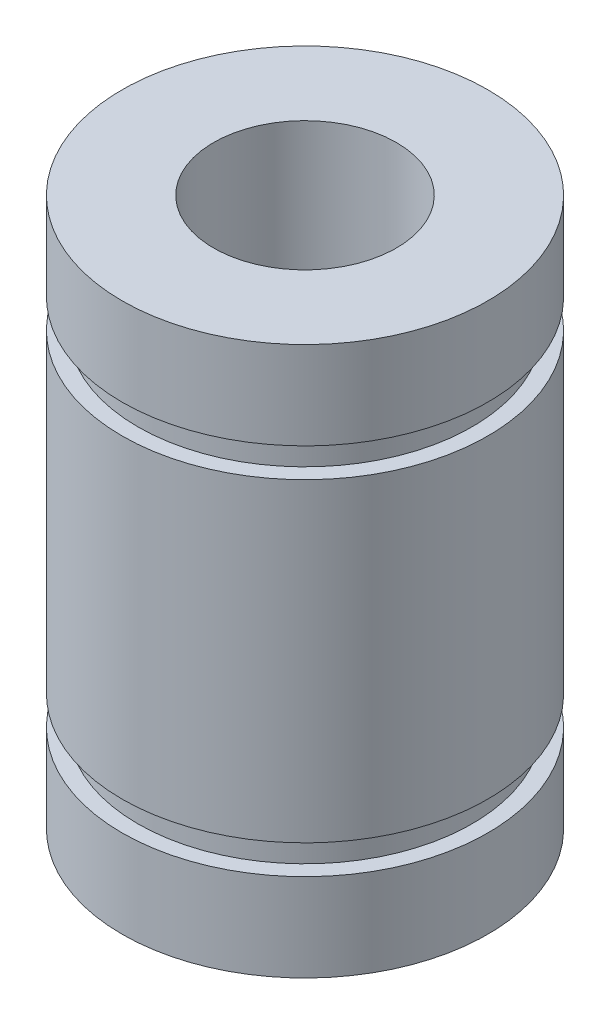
ISO-10303-21;
HEADER;
FILE_DESCRIPTION(('STEP AP214'),'2;1');
FILE_NAME('part.step','',(''),(''),'','','');
FILE_SCHEMA(('AUTOMOTIVE_DESIGN { 1 0 10303 214 1 1 1 1 }'));
ENDSEC;
DATA;
#1=APPLICATION_CONTEXT('core data for automotive mechanical design processes');
#2=APPLICATION_PROTOCOL_DEFINITION('international standard','automotive_design',2000,#1);
#3=PRODUCT_CONTEXT('',#1,'mechanical');
#4=PRODUCT('Part','Part','',(#3));
#5=PRODUCT_RELATED_PRODUCT_CATEGORY('part','',(#4));
#6=PRODUCT_DEFINITION_FORMATION('','',#4);
#7=PRODUCT_DEFINITION_CONTEXT('part definition',#1,'design');
#8=PRODUCT_DEFINITION('design','',#6,#7);
#9=PRODUCT_DEFINITION_SHAPE('','',#8);
#10=(LENGTH_UNIT() NAMED_UNIT(*) SI_UNIT(.MILLI.,.METRE.));
#11=(NAMED_UNIT(*) PLANE_ANGLE_UNIT() SI_UNIT($,.RADIAN.));
#12=(NAMED_UNIT(*) SI_UNIT($,.STERADIAN.) SOLID_ANGLE_UNIT());
#13=UNCERTAINTY_MEASURE_WITH_UNIT(LENGTH_MEASURE(1.E-05),#10,'distance_accuracy_value','');
#14=(GEOMETRIC_REPRESENTATION_CONTEXT(3) GLOBAL_UNCERTAINTY_ASSIGNED_CONTEXT((#13)) GLOBAL_UNIT_ASSIGNED_CONTEXT((#10,
#11,#12)) REPRESENTATION_CONTEXT('',''));
#15=CARTESIAN_POINT('',(0.,0.,0.));
#16=DIRECTION('',(0.,0.,1.));
#17=DIRECTION('',(1.,0.,0.));
#18=AXIS2_PLACEMENT_3D('',#15,#16,#17);
#19=CARTESIAN_POINT('',(0.,19.05,0.));
#20=DIRECTION('',(0.,-1.,0.));
#21=DIRECTION('',(0.,0.,-1.));
#22=AXIS2_PLACEMENT_3D('',#19,#20,#21);
#23=CYLINDRICAL_SURFACE('',#22,6.35);
#24=CARTESIAN_POINT('',(0.,19.05,0.));
#25=DIRECTION('',(0.,1.,0.));
#26=DIRECTION('',(0.,0.,1.));
#27=AXIS2_PLACEMENT_3D('',#24,#25,#26);
#28=CIRCLE('',#27,6.35);
#29=CARTESIAN_POINT('',(0.,19.05,-6.35));
#30=VERTEX_POINT('',#29);
#31=EDGE_CURVE('E10',#30,#30,#28,.T.);
#32=CARTESIAN_POINT('',(0.,16.002,0.));
#33=DIRECTION('',(0.,-1.,0.));
#34=DIRECTION('',(0.,0.,-1.));
#35=AXIS2_PLACEMENT_3D('',#32,#33,#34);
#36=CIRCLE('',#35,6.35);
#37=CARTESIAN_POINT('',(0.,16.002,-6.35));
#38=VERTEX_POINT('',#37);
#39=EDGE_CURVE('E71',#38,#38,#36,.T.);
#40=CARTESIAN_POINT('',(0.,19.05,-6.35));
#41=CARTESIAN_POINT('',(0.,19.01825,-6.35));
#42=CARTESIAN_POINT('',(0.,18.9865,-6.35));
#43=CARTESIAN_POINT('',(0.,18.923,-6.35));
#44=CARTESIAN_POINT('',(0.,18.89125,-6.35));
#45=CARTESIAN_POINT('',(0.,18.82775,-6.35));
#46=CARTESIAN_POINT('',(0.,18.796,-6.35));
#47=CARTESIAN_POINT('',(0.,18.7325,-6.35));
#48=CARTESIAN_POINT('',(0.,18.70075,-6.35));
#49=CARTESIAN_POINT('',(0.,18.63725,-6.35));
#50=CARTESIAN_POINT('',(0.,18.6055,-6.35));
#51=CARTESIAN_POINT('',(0.,18.542,-6.35));
#52=CARTESIAN_POINT('',(0.,18.51025,-6.35));
#53=CARTESIAN_POINT('',(0.,18.44675,-6.35));
#54=CARTESIAN_POINT('',(0.,18.415,-6.35));
#55=CARTESIAN_POINT('',(0.,18.3515,-6.35));
#56=CARTESIAN_POINT('',(0.,18.31975,-6.35));
#57=CARTESIAN_POINT('',(0.,18.25625,-6.35));
#58=CARTESIAN_POINT('',(0.,18.2245,-6.35));
#59=CARTESIAN_POINT('',(0.,18.161,-6.35));
#60=CARTESIAN_POINT('',(0.,18.12925,-6.35));
#61=CARTESIAN_POINT('',(0.,18.06575,-6.35));
#62=CARTESIAN_POINT('',(0.,18.034,-6.35));
#63=CARTESIAN_POINT('',(0.,17.9705,-6.35));
#64=CARTESIAN_POINT('',(0.,17.93875,-6.35));
#65=CARTESIAN_POINT('',(0.,17.87525,-6.35));
#66=CARTESIAN_POINT('',(0.,17.8435,-6.35));
#67=CARTESIAN_POINT('',(0.,17.78,-6.35));
#68=CARTESIAN_POINT('',(0.,17.74825,-6.35));
#69=CARTESIAN_POINT('',(0.,17.68475,-6.35));
#70=CARTESIAN_POINT('',(0.,17.653,-6.35));
#71=CARTESIAN_POINT('',(0.,17.5895,-6.35));
#72=CARTESIAN_POINT('',(0.,17.55775,-6.35));
#73=CARTESIAN_POINT('',(0.,17.49425,-6.35));
#74=CARTESIAN_POINT('',(0.,17.4625,-6.35));
#75=CARTESIAN_POINT('',(0.,17.399,-6.35));
#76=CARTESIAN_POINT('',(0.,17.36725,-6.35));
#77=CARTESIAN_POINT('',(0.,17.30375,-6.35));
#78=CARTESIAN_POINT('',(0.,17.272,-6.35));
#79=CARTESIAN_POINT('',(0.,17.2085,-6.35));
#80=CARTESIAN_POINT('',(0.,17.17675,-6.35));
#81=CARTESIAN_POINT('',(0.,17.11325,-6.35));
#82=CARTESIAN_POINT('',(0.,17.0815,-6.35));
#83=CARTESIAN_POINT('',(0.,17.018,-6.35));
#84=CARTESIAN_POINT('',(0.,16.98625,-6.35));
#85=CARTESIAN_POINT('',(0.,16.92275,-6.35));
#86=CARTESIAN_POINT('',(0.,16.891,-6.35));
#87=CARTESIAN_POINT('',(0.,16.8275,-6.35));
#88=CARTESIAN_POINT('',(0.,16.79575,-6.35));
#89=CARTESIAN_POINT('',(0.,16.73225,-6.35));
#90=CARTESIAN_POINT('',(0.,16.7005,-6.35));
#91=CARTESIAN_POINT('',(0.,16.637,-6.35));
#92=CARTESIAN_POINT('',(0.,16.60525,-6.35));
#93=CARTESIAN_POINT('',(0.,16.54175,-6.35));
#94=CARTESIAN_POINT('',(0.,16.51,-6.35));
#95=CARTESIAN_POINT('',(0.,16.4465,-6.35));
#96=CARTESIAN_POINT('',(0.,16.41475,-6.35));
#97=CARTESIAN_POINT('',(0.,16.35125,-6.35));
#98=CARTESIAN_POINT('',(0.,16.3195,-6.35));
#99=CARTESIAN_POINT('',(0.,16.256,-6.35));
#100=CARTESIAN_POINT('',(0.,16.22425,-6.35));
#101=CARTESIAN_POINT('',(0.,16.16075,-6.35));
#102=CARTESIAN_POINT('',(0.,16.129,-6.35));
#103=CARTESIAN_POINT('',(0.,16.0655,-6.35));
#104=CARTESIAN_POINT('',(0.,16.03375,-6.35));
#105=CARTESIAN_POINT('',(0.,16.002,-6.35));
#106=B_SPLINE_CURVE_WITH_KNOTS('',3,(#40,#41,#42,#43,#44,#45,#46,#47,#48,#49,#50,#51,#52,#53,
#54,#55,#56,#57,#58,#59,#60,#61,#62,#63,#64,#65,#66,#67,#68,#69,#70,#71,#72,#73,#74,#75,#76,#77,
#78,#79,#80,#81,#82,#83,#84,#85,#86,#87,#88,#89,#90,#91,#92,#93,#94,#95,#96,#97,#98,#99,#100,
#101,#102,#103,#104,#105),.UNSPECIFIED.,.F.,.F.,(4,2,2,2,2,2,2,2,2,2,2,2,2,2,2,2,2,2,2,2,2,2,2,
2,2,2,2,2,2,2,2,2,4),(0.,0.0952499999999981,0.190499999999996,0.285749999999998,
0.380999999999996,0.476249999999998,0.571499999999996,0.666749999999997,0.761999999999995,
0.857249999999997,0.952499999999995,1.04775,1.14299999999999,1.23825,1.33349999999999,1.42875,
1.52399999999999,1.61925,1.71449999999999,1.80975,1.90499999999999,2.00024999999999,
2.09549999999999,2.19074999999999,2.28599999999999,2.38124999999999,2.47649999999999,
2.57174999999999,2.66699999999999,2.76224999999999,2.85749999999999,2.95274999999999,
3.04799999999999),.UNSPECIFIED.);
#107=EDGE_CURVE('BSEAM38',#30,#38,#106,.T.);
#108=ORIENTED_EDGE('',*,*,#31,.F.);
#109=ORIENTED_EDGE('',*,*,#39,.F.);
#110=ORIENTED_EDGE('',*,*,#107,.T.);
#111=ORIENTED_EDGE('',*,*,#107,.F.);
#112=EDGE_LOOP('',(#108,#110,#109,#111));
#113=FACE_BOUND('',#112,.T.);
#114=ADVANCED_FACE('F38',(#113),#23,.T.);
#115=CARTESIAN_POINT('',(0.,0.,0.));
#116=DIRECTION('',(0.,1.,0.));
#117=DIRECTION('',(0.,0.,1.));
#118=AXIS2_PLACEMENT_3D('',#115,#116,#117);
#119=CIRCLE('',#118,6.35);
#120=CARTESIAN_POINT('',(0.,0.,-6.35));
#121=VERTEX_POINT('',#120);
#122=EDGE_CURVE('E41',#121,#121,#119,.T.);
#123=CARTESIAN_POINT('',(0.,3.048,0.));
#124=DIRECTION('',(0.,-1.,0.));
#125=DIRECTION('',(0.,0.,-1.));
#126=AXIS2_PLACEMENT_3D('',#123,#124,#125);
#127=CIRCLE('',#126,6.35);
#128=CARTESIAN_POINT('',(0.,3.048,-6.35));
#129=VERTEX_POINT('',#128);
#130=EDGE_CURVE('E66',#129,#129,#127,.T.);
#131=CARTESIAN_POINT('',(0.,0.,-6.35));
#132=CARTESIAN_POINT('',(0.,0.0317500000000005,-6.35));
#133=CARTESIAN_POINT('',(0.,0.0635000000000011,-6.35));
#134=CARTESIAN_POINT('',(0.,0.127000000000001,-6.35));
#135=CARTESIAN_POINT('',(0.,0.15875,-6.35));
#136=CARTESIAN_POINT('',(0.,0.22225,-6.35));
#137=CARTESIAN_POINT('',(0.,0.254000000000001,-6.35));
#138=CARTESIAN_POINT('',(0.,0.317500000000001,-6.35));
#139=CARTESIAN_POINT('',(0.,0.34925,-6.35));
#140=CARTESIAN_POINT('',(0.,0.41275,-6.35));
#141=CARTESIAN_POINT('',(0.,0.4445,-6.35));
#142=CARTESIAN_POINT('',(0.,0.508,-6.35));
#143=CARTESIAN_POINT('',(0.,0.53975,-6.35));
#144=CARTESIAN_POINT('',(0.,0.60325,-6.35));
#145=CARTESIAN_POINT('',(0.,0.635,-6.35));
#146=CARTESIAN_POINT('',(0.,0.6985,-6.35));
#147=CARTESIAN_POINT('',(0.,0.730249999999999,-6.35));
#148=CARTESIAN_POINT('',(0.,0.793749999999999,-6.35));
#149=CARTESIAN_POINT('',(0.,0.8255,-6.35));
#150=CARTESIAN_POINT('',(0.,0.889000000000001,-6.35));
#151=CARTESIAN_POINT('',(0.,0.920750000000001,-6.35));
#152=CARTESIAN_POINT('',(0.,0.984250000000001,-6.35));
#153=CARTESIAN_POINT('',(0.,1.016,-6.35));
#154=CARTESIAN_POINT('',(0.,1.0795,-6.35));
#155=CARTESIAN_POINT('',(0.,1.11125,-6.35));
#156=CARTESIAN_POINT('',(0.,1.17475,-6.35));
#157=CARTESIAN_POINT('',(0.,1.2065,-6.35));
#158=CARTESIAN_POINT('',(0.,1.27,-6.35));
#159=CARTESIAN_POINT('',(0.,1.30175,-6.35));
#160=CARTESIAN_POINT('',(0.,1.36525,-6.35));
#161=CARTESIAN_POINT('',(0.,1.397,-6.35));
#162=CARTESIAN_POINT('',(0.,1.4605,-6.35));
#163=CARTESIAN_POINT('',(0.,1.49225,-6.35));
#164=CARTESIAN_POINT('',(0.,1.55575,-6.35));
#165=CARTESIAN_POINT('',(0.,1.5875,-6.35));
#166=CARTESIAN_POINT('',(0.,1.651,-6.35));
#167=CARTESIAN_POINT('',(0.,1.68275,-6.35));
#168=CARTESIAN_POINT('',(0.,1.74625,-6.35));
#169=CARTESIAN_POINT('',(0.,1.778,-6.35));
#170=CARTESIAN_POINT('',(0.,1.8415,-6.35));
#171=CARTESIAN_POINT('',(0.,1.87325,-6.35));
#172=CARTESIAN_POINT('',(0.,1.93675,-6.35));
#173=CARTESIAN_POINT('',(0.,1.9685,-6.35));
#174=CARTESIAN_POINT('',(0.,2.032,-6.35));
#175=CARTESIAN_POINT('',(0.,2.06375,-6.35));
#176=CARTESIAN_POINT('',(0.,2.12725,-6.35));
#177=CARTESIAN_POINT('',(0.,2.159,-6.35));
#178=CARTESIAN_POINT('',(0.,2.2225,-6.35));
#179=CARTESIAN_POINT('',(0.,2.25425,-6.35));
#180=CARTESIAN_POINT('',(0.,2.31775,-6.35));
#181=CARTESIAN_POINT('',(0.,2.3495,-6.35));
#182=CARTESIAN_POINT('',(0.,2.413,-6.35));
#183=CARTESIAN_POINT('',(0.,2.44475,-6.35));
#184=CARTESIAN_POINT('',(0.,2.50825,-6.35));
#185=CARTESIAN_POINT('',(0.,2.54,-6.35));
#186=CARTESIAN_POINT('',(0.,2.6035,-6.35));
#187=CARTESIAN_POINT('',(0.,2.63525,-6.35));
#188=CARTESIAN_POINT('',(0.,2.69875,-6.35));
#189=CARTESIAN_POINT('',(0.,2.7305,-6.35));
#190=CARTESIAN_POINT('',(0.,2.794,-6.35));
#191=CARTESIAN_POINT('',(0.,2.82575,-6.35));
#192=CARTESIAN_POINT('',(0.,2.88925,-6.35));
#193=CARTESIAN_POINT('',(0.,2.921,-6.35));
#194=CARTESIAN_POINT('',(0.,2.9845,-6.35));
#195=CARTESIAN_POINT('',(0.,3.01625,-6.35));
#196=CARTESIAN_POINT('',(0.,3.048,-6.35));
#197=B_SPLINE_CURVE_WITH_KNOTS('',3,(#131,#132,#133,#134,#135,#136,#137,#138,#139,#140,#141,
#142,#143,#144,#145,#146,#147,#148,#149,#150,#151,#152,#153,#154,#155,#156,#157,#158,#159,#160,
#161,#162,#163,#164,#165,#166,#167,#168,#169,#170,#171,#172,#173,#174,#175,#176,#177,#178,#179,
#180,#181,#182,#183,#184,#185,#186,#187,#188,#189,#190,#191,#192,#193,#194,#195,#196),
.UNSPECIFIED.,.F.,.F.,(4,2,2,2,2,2,2,2,2,2,2,2,2,2,2,2,2,2,2,2,2,2,2,2,2,2,2,2,2,2,2,2,4),(0.,
0.0952500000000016,0.1905,0.285750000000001,0.380999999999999,0.476250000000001,
0.571499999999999,0.666750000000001,0.761999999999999,0.85725,0.952500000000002,1.04775,1.143,
1.23825,1.3335,1.42875,1.524,1.61925,1.7145,1.80975,1.905,2.00025,2.0955,2.19075,2.286,2.38125,
2.4765,2.57175,2.667,2.76225,2.8575,2.95275,3.048),.UNSPECIFIED.);
#198=EDGE_CURVE('BSEAM99',#121,#129,#197,.T.);
#199=ORIENTED_EDGE('',*,*,#122,.T.);
#200=ORIENTED_EDGE('',*,*,#130,.T.);
#201=ORIENTED_EDGE('',*,*,#198,.T.);
#202=ORIENTED_EDGE('',*,*,#198,.F.);
#203=EDGE_LOOP('',(#199,#201,#200,#202));
#204=FACE_BOUND('',#203,.T.);
#205=ADVANCED_FACE('F99',(#204),#23,.T.);
#206=CARTESIAN_POINT('',(0.,19.05,0.));
#207=DIRECTION('',(0.,1.,0.));
#208=DIRECTION('',(0.,0.,1.));
#209=AXIS2_PLACEMENT_3D('',#206,#207,#208);
#210=PLANE('',#209);
#211=ORIENTED_EDGE('',*,*,#31,.T.);
#212=EDGE_LOOP('',(#211));
#213=FACE_BOUND('',#212,.T.);
#214=CARTESIAN_POINT('',(0.,19.05,0.));
#215=DIRECTION('',(0.,1.,0.));
#216=DIRECTION('',(0.,0.,1.));
#217=AXIS2_PLACEMENT_3D('',#214,#215,#216);
#218=CIRCLE('',#217,3.175);
#219=CARTESIAN_POINT('',(0.,19.05,-3.175));
#220=VERTEX_POINT('',#219);
#221=EDGE_CURVE('E48',#220,#220,#218,.T.);
#222=ORIENTED_EDGE('',*,*,#221,.F.);
#223=EDGE_LOOP('',(#222));
#224=FACE_BOUND('',#223,.T.);
#225=ADVANCED_FACE('F105',(#213,#224),#210,.T.);
#226=CARTESIAN_POINT('',(0.,0.,0.));
#227=DIRECTION('',(0.,1.,0.));
#228=DIRECTION('',(0.,0.,1.));
#229=AXIS2_PLACEMENT_3D('',#226,#227,#228);
#230=PLANE('',#229);
#231=ORIENTED_EDGE('',*,*,#122,.F.);
#232=EDGE_LOOP('',(#231));
#233=FACE_BOUND('',#232,.T.);
#234=CARTESIAN_POINT('',(0.,0.,0.));
#235=DIRECTION('',(0.,1.,0.));
#236=DIRECTION('',(0.,0.,1.));
#237=AXIS2_PLACEMENT_3D('',#234,#235,#236);
#238=CIRCLE('',#237,3.175);
#239=CARTESIAN_POINT('',(0.,0.,-3.175));
#240=VERTEX_POINT('',#239);
#241=EDGE_CURVE('E50',#240,#240,#238,.T.);
#242=ORIENTED_EDGE('',*,*,#241,.T.);
#243=EDGE_LOOP('',(#242));
#244=FACE_BOUND('',#243,.T.);
#245=ADVANCED_FACE('F135',(#233,#244),#230,.F.);
#246=CARTESIAN_POINT('',(0.,19.05,0.));
#247=DIRECTION('',(0.,-1.,0.));
#248=DIRECTION('',(0.,0.,-1.));
#249=AXIS2_PLACEMENT_3D('',#246,#247,#248);
#250=CYLINDRICAL_SURFACE('',#249,3.175);
#251=CARTESIAN_POINT('',(0.,19.05,-3.175));
#252=CARTESIAN_POINT('',(0.,18.8515625,-3.175));
#253=CARTESIAN_POINT('',(0.,18.653125,-3.175));
#254=CARTESIAN_POINT('',(0.,18.25625,-3.175));
#255=CARTESIAN_POINT('',(0.,18.0578125,-3.175));
#256=CARTESIAN_POINT('',(0.,17.6609375,-3.175));
#257=CARTESIAN_POINT('',(0.,17.4625,-3.175));
#258=CARTESIAN_POINT('',(0.,17.065625,-3.175));
#259=CARTESIAN_POINT('',(0.,16.8671875,-3.175));
#260=CARTESIAN_POINT('',(0.,16.4703125,-3.175));
#261=CARTESIAN_POINT('',(0.,16.271875,-3.175));
#262=CARTESIAN_POINT('',(0.,15.875,-3.175));
#263=CARTESIAN_POINT('',(0.,15.6765625,-3.175));
#264=CARTESIAN_POINT('',(0.,15.2796875,-3.175));
#265=CARTESIAN_POINT('',(0.,15.08125,-3.175));
#266=CARTESIAN_POINT('',(0.,14.684375,-3.175));
#267=CARTESIAN_POINT('',(0.,14.4859375,-3.175));
#268=CARTESIAN_POINT('',(0.,14.0890625,-3.175));
#269=CARTESIAN_POINT('',(0.,13.890625,-3.175));
#270=CARTESIAN_POINT('',(0.,13.49375,-3.175));
#271=CARTESIAN_POINT('',(0.,13.2953125,-3.175));
#272=CARTESIAN_POINT('',(0.,12.8984375,-3.175));
#273=CARTESIAN_POINT('',(0.,12.7,-3.175));
#274=CARTESIAN_POINT('',(0.,12.303125,-3.175));
#275=CARTESIAN_POINT('',(0.,12.1046875,-3.175));
#276=CARTESIAN_POINT('',(0.,11.7078125,-3.175));
#277=CARTESIAN_POINT('',(0.,11.509375,-3.175));
#278=CARTESIAN_POINT('',(0.,11.1125,-3.175));
#279=CARTESIAN_POINT('',(0.,10.9140625,-3.175));
#280=CARTESIAN_POINT('',(0.,10.5171875,-3.175));
#281=CARTESIAN_POINT('',(0.,10.31875,-3.175));
#282=CARTESIAN_POINT('',(0.,9.921875,-3.175));
#283=CARTESIAN_POINT('',(0.,9.7234375,-3.175));
#284=CARTESIAN_POINT('',(0.,9.3265625,-3.175));
#285=CARTESIAN_POINT('',(0.,9.128125,-3.175));
#286=CARTESIAN_POINT('',(0.,8.73125,-3.175));
#287=CARTESIAN_POINT('',(0.,8.5328125,-3.175));
#288=CARTESIAN_POINT('',(0.,8.1359375,-3.175));
#289=CARTESIAN_POINT('',(0.,7.9375,-3.175));
#290=CARTESIAN_POINT('',(0.,7.540625,-3.175));
#291=CARTESIAN_POINT('',(0.,7.3421875,-3.175));
#292=CARTESIAN_POINT('',(0.,6.9453125,-3.175));
#293=CARTESIAN_POINT('',(0.,6.746875,-3.175));
#294=CARTESIAN_POINT('',(0.,6.35,-3.175));
#295=CARTESIAN_POINT('',(0.,6.1515625,-3.175));
#296=CARTESIAN_POINT('',(0.,5.7546875,-3.175));
#297=CARTESIAN_POINT('',(0.,5.55625,-3.175));
#298=CARTESIAN_POINT('',(0.,5.159375,-3.175));
#299=CARTESIAN_POINT('',(0.,4.9609375,-3.175));
#300=CARTESIAN_POINT('',(0.,4.5640625,-3.175));
#301=CARTESIAN_POINT('',(0.,4.365625,-3.175));
#302=CARTESIAN_POINT('',(0.,3.96875,-3.175));
#303=CARTESIAN_POINT('',(0.,3.7703125,-3.175));
#304=CARTESIAN_POINT('',(0.,3.3734375,-3.175));
#305=CARTESIAN_POINT('',(0.,3.175,-3.175));
#306=CARTESIAN_POINT('',(0.,2.778125,-3.175));
#307=CARTESIAN_POINT('',(0.,2.5796875,-3.175));
#308=CARTESIAN_POINT('',(0.,2.1828125,-3.175));
#309=CARTESIAN_POINT('',(0.,1.984375,-3.175));
#310=CARTESIAN_POINT('',(0.,1.5875,-3.175));
#311=CARTESIAN_POINT('',(0.,1.3890625,-3.175));
#312=CARTESIAN_POINT('',(0.,0.992187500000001,-3.175));
#313=CARTESIAN_POINT('',(0.,0.793750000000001,-3.175));
#314=CARTESIAN_POINT('',(0.,0.396875,-3.175));
#315=CARTESIAN_POINT('',(0.,0.1984375,-3.175));
#316=CARTESIAN_POINT('',(0.,0.,-3.175));
#317=B_SPLINE_CURVE_WITH_KNOTS('',3,(#251,#252,#253,#254,#255,#256,#257,#258,#259,#260,#261,
#262,#263,#264,#265,#266,#267,#268,#269,#270,#271,#272,#273,#274,#275,#276,#277,#278,#279,#280,
#281,#282,#283,#284,#285,#286,#287,#288,#289,#290,#291,#292,#293,#294,#295,#296,#297,#298,#299,
#300,#301,#302,#303,#304,#305,#306,#307,#308,#309,#310,#311,#312,#313,#314,#315,#316),
.UNSPECIFIED.,.F.,.F.,(4,2,2,2,2,2,2,2,2,2,2,2,2,2,2,2,2,2,2,2,2,2,2,2,2,2,2,2,2,2,2,2,4),(0.,
0.595312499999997,1.190625,1.7859375,2.38125,2.9765625,3.571875,4.1671875,4.7625,5.3578125,
5.953125,6.5484375,7.14375,7.7390625,8.334375,8.9296875,9.525,10.1203125,10.715625,11.3109375,
11.90625,12.5015625,13.096875,13.6921875,14.2875,14.8828125,15.478125,16.0734375,16.66875,
17.2640625,17.859375,18.4546875,19.05),.UNSPECIFIED.);
#318=EDGE_CURVE('BSEAM128',#220,#240,#317,.T.);
#319=ORIENTED_EDGE('',*,*,#221,.T.);
#320=ORIENTED_EDGE('',*,*,#241,.F.);
#321=ORIENTED_EDGE('',*,*,#318,.T.);
#322=ORIENTED_EDGE('',*,*,#318,.F.);
#323=EDGE_LOOP('',(#319,#321,#320,#322));
#324=FACE_BOUND('',#323,.T.);
#325=ADVANCED_FACE('F128',(#324),#250,.F.);
#326=CARTESIAN_POINT('',(-6.35,3.048,0.));
#327=DIRECTION('',(0.,1.,0.));
#328=DIRECTION('',(0.,0.,1.));
#329=AXIS2_PLACEMENT_3D('',#326,#327,#328);
#330=PLANE('',#329);
#331=CARTESIAN_POINT('',(0.,3.048,0.));
#332=DIRECTION('',(0.,-1.,0.));
#333=DIRECTION('',(0.,0.,-1.));
#334=AXIS2_PLACEMENT_3D('',#331,#332,#333);
#335=CIRCLE('',#334,5.80333762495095);
#336=CARTESIAN_POINT('',(0.,3.048,-5.80333762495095));
#337=VERTEX_POINT('',#336);
#338=EDGE_CURVE('E56',#337,#337,#335,.T.);
#339=ORIENTED_EDGE('',*,*,#338,.T.);
#340=EDGE_LOOP('',(#339));
#341=FACE_BOUND('',#340,.T.);
#342=ORIENTED_EDGE('',*,*,#130,.F.);
#343=EDGE_LOOP('',(#342));
#344=FACE_BOUND('',#343,.T.);
#345=ADVANCED_FACE('F122',(#341,#344),#330,.T.);
#346=CARTESIAN_POINT('',(0.,0.,0.));
#347=DIRECTION('',(0.,-1.,0.));
#348=DIRECTION('',(0.,0.,-1.));
#349=AXIS2_PLACEMENT_3D('',#346,#347,#348);
#350=CYLINDRICAL_SURFACE('',#349,5.80333762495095);
#351=CARTESIAN_POINT('',(0.,4.064,0.));
#352=DIRECTION('',(0.,-1.,0.));
#353=DIRECTION('',(0.,0.,-1.));
#354=AXIS2_PLACEMENT_3D('',#351,#352,#353);
#355=CIRCLE('',#354,5.80333762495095);
#356=CARTESIAN_POINT('',(0.,4.064,-5.80333762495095));
#357=VERTEX_POINT('',#356);
#358=EDGE_CURVE('E60',#357,#357,#355,.T.);
#359=ORIENTED_EDGE('',*,*,#358,.T.);
#360=EDGE_LOOP('',(#359));
#361=FACE_BOUND('',#360,.T.);
#362=ORIENTED_EDGE('',*,*,#338,.F.);
#363=EDGE_LOOP('',(#362));
#364=FACE_BOUND('',#363,.T.);
#365=ADVANCED_FACE('F95',(#361,#364),#350,.T.);
#366=CARTESIAN_POINT('',(-6.35,4.064,0.));
#367=DIRECTION('',(0.,-1.,0.));
#368=DIRECTION('',(0.,0.,-1.));
#369=AXIS2_PLACEMENT_3D('',#366,#367,#368);
#370=PLANE('',#369);
#371=CARTESIAN_POINT('',(0.,4.064,0.));
#372=DIRECTION('',(0.,-1.,0.));
#373=DIRECTION('',(0.,0.,-1.));
#374=AXIS2_PLACEMENT_3D('',#371,#372,#373);
#375=CIRCLE('',#374,6.35);
#376=CARTESIAN_POINT('',(0.,4.064,-6.35));
#377=VERTEX_POINT('',#376);
#378=EDGE_CURVE('E63',#377,#377,#375,.T.);
#379=ORIENTED_EDGE('',*,*,#378,.T.);
#380=EDGE_LOOP('',(#379));
#381=FACE_BOUND('',#380,.T.);
#382=ORIENTED_EDGE('',*,*,#358,.F.);
#383=EDGE_LOOP('',(#382));
#384=FACE_BOUND('',#383,.T.);
#385=ADVANCED_FACE('F86',(#381,#384),#370,.T.);
#386=CARTESIAN_POINT('',(0.,0.,0.));
#387=DIRECTION('',(0.,-1.,0.));
#388=DIRECTION('',(0.,0.,-1.));
#389=AXIS2_PLACEMENT_3D('',#386,#387,#388);
#390=CYLINDRICAL_SURFACE('',#389,5.80333762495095);
#391=CARTESIAN_POINT('',(0.,16.002,0.));
#392=DIRECTION('',(0.,-1.,0.));
#393=DIRECTION('',(0.,0.,-1.));
#394=AXIS2_PLACEMENT_3D('',#391,#392,#393);
#395=CIRCLE('',#394,5.80333762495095);
#396=CARTESIAN_POINT('',(0.,16.002,-5.80333762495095));
#397=VERTEX_POINT('',#396);
#398=EDGE_CURVE('E53',#397,#397,#395,.T.);
#399=ORIENTED_EDGE('',*,*,#398,.T.);
#400=EDGE_LOOP('',(#399));
#401=FACE_BOUND('',#400,.T.);
#402=CARTESIAN_POINT('',(0.,14.986,0.));
#403=DIRECTION('',(0.,-1.,0.));
#404=DIRECTION('',(0.,0.,-1.));
#405=AXIS2_PLACEMENT_3D('',#402,#403,#404);
#406=CIRCLE('',#405,5.80333762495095);
#407=CARTESIAN_POINT('',(0.,14.986,-5.80333762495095));
#408=VERTEX_POINT('',#407);
#409=EDGE_CURVE('E59',#408,#408,#406,.T.);
#410=ORIENTED_EDGE('',*,*,#409,.F.);
#411=EDGE_LOOP('',(#410));
#412=FACE_BOUND('',#411,.T.);
#413=ADVANCED_FACE('F83',(#401,#412),#390,.T.);
#414=CARTESIAN_POINT('',(-6.35,16.002,0.));
#415=DIRECTION('',(0.,-1.,0.));
#416=DIRECTION('',(0.,0.,-1.));
#417=AXIS2_PLACEMENT_3D('',#414,#415,#416);
#418=PLANE('',#417);
#419=ORIENTED_EDGE('',*,*,#39,.T.);
#420=EDGE_LOOP('',(#419));
#421=FACE_BOUND('',#420,.T.);
#422=ORIENTED_EDGE('',*,*,#398,.F.);
#423=EDGE_LOOP('',(#422));
#424=FACE_BOUND('',#423,.T.);
#425=ADVANCED_FACE('F85',(#421,#424),#418,.T.);
#426=CARTESIAN_POINT('',(-6.35,14.986,0.));
#427=DIRECTION('',(0.,1.,0.));
#428=DIRECTION('',(0.,0.,1.));
#429=AXIS2_PLACEMENT_3D('',#426,#427,#428);
#430=PLANE('',#429);
#431=ORIENTED_EDGE('',*,*,#409,.T.);
#432=EDGE_LOOP('',(#431));
#433=FACE_BOUND('',#432,.T.);
#434=CARTESIAN_POINT('',(0.,14.986,0.));
#435=DIRECTION('',(0.,-1.,0.));
#436=DIRECTION('',(0.,0.,-1.));
#437=AXIS2_PLACEMENT_3D('',#434,#435,#436);
#438=CIRCLE('',#437,6.35);
#439=CARTESIAN_POINT('',(0.,14.986,-6.35));
#440=VERTEX_POINT('',#439);
#441=EDGE_CURVE('E74',#440,#440,#438,.T.);
#442=ORIENTED_EDGE('',*,*,#441,.F.);
#443=EDGE_LOOP('',(#442));
#444=FACE_BOUND('',#443,.T.);
#445=ADVANCED_FACE('F80',(#433,#444),#430,.T.);
#446=CARTESIAN_POINT('',(0.,4.064,-6.35));
#447=CARTESIAN_POINT('',(0.,4.17777083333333,-6.35));
#448=CARTESIAN_POINT('',(0.,4.29154166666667,-6.35));
#449=CARTESIAN_POINT('',(0.,4.51908333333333,-6.35));
#450=CARTESIAN_POINT('',(0.,4.63285416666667,-6.35));
#451=CARTESIAN_POINT('',(0.,4.86039583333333,-6.35));
#452=CARTESIAN_POINT('',(0.,4.97416666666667,-6.35));
#453=CARTESIAN_POINT('',(0.,5.20170833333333,-6.35));
#454=CARTESIAN_POINT('',(0.,5.31547916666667,-6.35));
#455=CARTESIAN_POINT('',(0.,5.54302083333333,-6.35));
#456=CARTESIAN_POINT('',(0.,5.65679166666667,-6.35));
#457=CARTESIAN_POINT('',(0.,5.88433333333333,-6.35));
#458=CARTESIAN_POINT('',(0.,5.99810416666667,-6.35));
#459=CARTESIAN_POINT('',(0.,6.22564583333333,-6.35));
#460=CARTESIAN_POINT('',(0.,6.33941666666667,-6.35));
#461=CARTESIAN_POINT('',(0.,6.56695833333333,-6.35));
#462=CARTESIAN_POINT('',(0.,6.68072916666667,-6.35));
#463=CARTESIAN_POINT('',(0.,6.90827083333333,-6.35));
#464=CARTESIAN_POINT('',(0.,7.02204166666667,-6.35));
#465=CARTESIAN_POINT('',(0.,7.24958333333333,-6.35));
#466=CARTESIAN_POINT('',(0.,7.36335416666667,-6.35));
#467=CARTESIAN_POINT('',(0.,7.59089583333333,-6.35));
#468=CARTESIAN_POINT('',(0.,7.70466666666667,-6.35));
#469=CARTESIAN_POINT('',(0.,7.93220833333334,-6.35));
#470=CARTESIAN_POINT('',(0.,8.04597916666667,-6.35));
#471=CARTESIAN_POINT('',(0.,8.27352083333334,-6.35));
#472=CARTESIAN_POINT('',(0.,8.38729166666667,-6.35));
#473=CARTESIAN_POINT('',(0.,8.61483333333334,-6.35));
#474=CARTESIAN_POINT('',(0.,8.72860416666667,-6.35));
#475=CARTESIAN_POINT('',(0.,8.95614583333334,-6.35));
#476=CARTESIAN_POINT('',(0.,9.06991666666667,-6.35));
#477=CARTESIAN_POINT('',(0.,9.29745833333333,-6.35));
#478=CARTESIAN_POINT('',(0.,9.41122916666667,-6.35));
#479=CARTESIAN_POINT('',(0.,9.63877083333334,-6.35));
#480=CARTESIAN_POINT('',(0.,9.75254166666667,-6.35));
#481=CARTESIAN_POINT('',(0.,9.98008333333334,-6.35));
#482=CARTESIAN_POINT('',(0.,10.0938541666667,-6.35));
#483=CARTESIAN_POINT('',(0.,10.3213958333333,-6.35));
#484=CARTESIAN_POINT('',(0.,10.4351666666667,-6.35));
#485=CARTESIAN_POINT('',(0.,10.6627083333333,-6.35));
#486=CARTESIAN_POINT('',(0.,10.7764791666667,-6.35));
#487=CARTESIAN_POINT('',(0.,11.0040208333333,-6.35));
#488=CARTESIAN_POINT('',(0.,11.1177916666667,-6.35));
#489=CARTESIAN_POINT('',(0.,11.3453333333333,-6.35));
#490=CARTESIAN_POINT('',(0.,11.4591041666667,-6.35));
#491=CARTESIAN_POINT('',(0.,11.6866458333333,-6.35));
#492=CARTESIAN_POINT('',(0.,11.8004166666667,-6.35));
#493=CARTESIAN_POINT('',(0.,12.0279583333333,-6.35));
#494=CARTESIAN_POINT('',(0.,12.1417291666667,-6.35));
#495=CARTESIAN_POINT('',(0.,12.3692708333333,-6.35));
#496=CARTESIAN_POINT('',(0.,12.4830416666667,-6.35));
#497=CARTESIAN_POINT('',(0.,12.7105833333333,-6.35));
#498=CARTESIAN_POINT('',(0.,12.8243541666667,-6.35));
#499=CARTESIAN_POINT('',(0.,13.0518958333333,-6.35));
#500=CARTESIAN_POINT('',(0.,13.1656666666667,-6.35));
#501=CARTESIAN_POINT('',(0.,13.3932083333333,-6.35));
#502=CARTESIAN_POINT('',(0.,13.5069791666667,-6.35));
#503=CARTESIAN_POINT('',(0.,13.7345208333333,-6.35));
#504=CARTESIAN_POINT('',(0.,13.8482916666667,-6.35));
#505=CARTESIAN_POINT('',(0.,14.0758333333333,-6.35));
#506=CARTESIAN_POINT('',(0.,14.1896041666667,-6.35));
#507=CARTESIAN_POINT('',(0.,14.4171458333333,-6.35));
#508=CARTESIAN_POINT('',(0.,14.5309166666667,-6.35));
#509=CARTESIAN_POINT('',(0.,14.7584583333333,-6.35));
#510=CARTESIAN_POINT('',(0.,14.8722291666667,-6.35));
#511=CARTESIAN_POINT('',(0.,14.986,-6.35));
#512=B_SPLINE_CURVE_WITH_KNOTS('',3,(#446,#447,#448,#449,#450,#451,#452,#453,#454,#455,#456,
#457,#458,#459,#460,#461,#462,#463,#464,#465,#466,#467,#468,#469,#470,#471,#472,#473,#474,#475,
#476,#477,#478,#479,#480,#481,#482,#483,#484,#485,#486,#487,#488,#489,#490,#491,#492,#493,#494,
#495,#496,#497,#498,#499,#500,#501,#502,#503,#504,#505,#506,#507,#508,#509,#510,#511),
.UNSPECIFIED.,.F.,.F.,(4,2,2,2,2,2,2,2,2,2,2,2,2,2,2,2,2,2,2,2,2,2,2,2,2,2,2,2,2,2,2,2,4),(0.,
0.3413125,0.682625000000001,1.0239375,1.36525,1.7065625,2.047875,2.3891875,2.7305,3.0718125,
3.413125,3.7544375,4.09575,4.4370625,4.778375,5.1196875,5.461,5.8023125,6.143625,6.4849375,
6.82625,7.1675625,7.508875,7.8501875,8.1915,8.5328125,8.874125,9.2154375,9.55675,9.8980625,
10.239375,10.5806875,10.922),.UNSPECIFIED.);
#513=EDGE_CURVE('BSEAM101',#377,#440,#512,.T.);
#514=ORIENTED_EDGE('',*,*,#378,.F.);
#515=ORIENTED_EDGE('',*,*,#441,.T.);
#516=ORIENTED_EDGE('',*,*,#513,.T.);
#517=ORIENTED_EDGE('',*,*,#513,.F.);
#518=EDGE_LOOP('',(#514,#516,#515,#517));
#519=FACE_BOUND('',#518,.T.);
#520=ADVANCED_FACE('F101',(#519),#23,.T.);
#521=CLOSED_SHELL('',(#114,#205,#225,#245,#325,#345,#365,#385,#413,#425,#445,#520));
#522=MANIFOLD_SOLID_BREP('B2',#521);
#523=ADVANCED_BREP_SHAPE_REPRESENTATION('',(#18,#522),#14);
#524=SHAPE_DEFINITION_REPRESENTATION(#9,#523);
ENDSEC;
END-ISO-10303-21;
